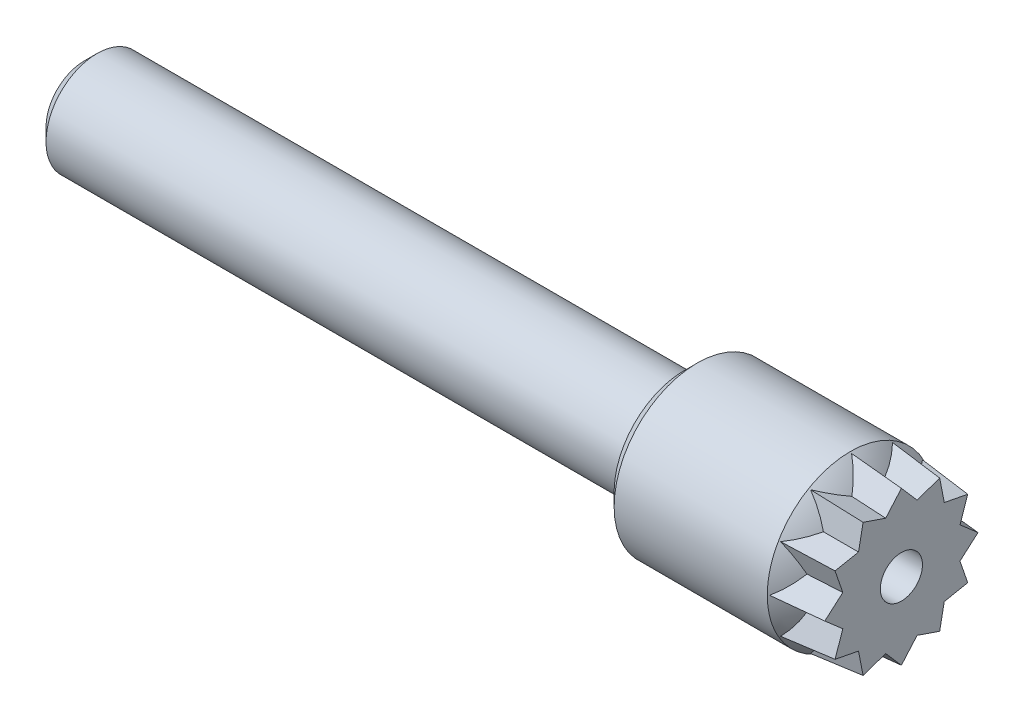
ISO-10303-21;
HEADER;
FILE_DESCRIPTION(('STEP AP214'),'2;1');
FILE_NAME('part.step','',(''),(''),'','','');
FILE_SCHEMA(('AUTOMOTIVE_DESIGN { 1 0 10303 214 1 1 1 1 }'));
ENDSEC;
DATA;
#1=APPLICATION_CONTEXT('core data for automotive mechanical design processes');
#2=APPLICATION_PROTOCOL_DEFINITION('international standard','automotive_design',2000,#1);
#3=PRODUCT_CONTEXT('',#1,'mechanical');
#4=PRODUCT('Part','Part','',(#3));
#5=PRODUCT_RELATED_PRODUCT_CATEGORY('part','',(#4));
#6=PRODUCT_DEFINITION_FORMATION('','',#4);
#7=PRODUCT_DEFINITION_CONTEXT('part definition',#1,'design');
#8=PRODUCT_DEFINITION('design','',#6,#7);
#9=PRODUCT_DEFINITION_SHAPE('','',#8);
#10=(LENGTH_UNIT() NAMED_UNIT(*) SI_UNIT(.MILLI.,.METRE.));
#11=(NAMED_UNIT(*) PLANE_ANGLE_UNIT() SI_UNIT($,.RADIAN.));
#12=(NAMED_UNIT(*) SI_UNIT($,.STERADIAN.) SOLID_ANGLE_UNIT());
#13=UNCERTAINTY_MEASURE_WITH_UNIT(LENGTH_MEASURE(1.E-05),#10,'distance_accuracy_value','');
#14=(GEOMETRIC_REPRESENTATION_CONTEXT(3) GLOBAL_UNCERTAINTY_ASSIGNED_CONTEXT((#13)) GLOBAL_UNIT_ASSIGNED_CONTEXT((#10,
#11,#12)) REPRESENTATION_CONTEXT('',''));
#15=CARTESIAN_POINT('',(0.,0.,0.));
#16=DIRECTION('',(0.,0.,1.));
#17=DIRECTION('',(1.,0.,0.));
#18=AXIS2_PLACEMENT_3D('',#15,#16,#17);
#19=CARTESIAN_POINT('',(-5.54166666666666,0.,0.));
#20=DIRECTION('',(0.,0.,1.));
#21=DIRECTION('',(1.,0.,0.));
#22=AXIS2_PLACEMENT_3D('',#19,#20,#21);
#23=SPHERICAL_SURFACE('',#22,8.54166666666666);
#24=CARTESIAN_POINT('',(-5.22105505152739,4.33641830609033,-1.4890707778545));
#25=DIRECTION('',(0.0697564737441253,0.943488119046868,-0.323981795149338));
#26=DIRECTION('',(0.,0.324772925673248,0.945792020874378));
#27=AXIS2_PLACEMENT_3D('',#24,#25,#26);
#28=CIRCLE('',#27,7.19968208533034);
#29=CARTESIAN_POINT('',(0.097558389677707,5.55602444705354,3.20777221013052));
#30=VERTEX_POINT('',#29);
#31=CARTESIAN_POINT('',(1.40617575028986,4.799354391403,1.2859831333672));
#32=VERTEX_POINT('',#31);
#33=EDGE_CURVE('E55',#30,#32,#28,.T.);
#34=ORIENTED_EDGE('',*,*,#33,.T.);
#35=CARTESIAN_POINT('',(-5.22105505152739,3.01091302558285,3.45778227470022));
#36=DIRECTION('',(0.0697564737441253,0.655093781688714,0.752320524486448));
#37=DIRECTION('',(0.,-0.754157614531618,0.656693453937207));
#38=AXIS2_PLACEMENT_3D('',#35,#36,#37);
#39=CIRCLE('',#38,7.19968208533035);
#40=CARTESIAN_POINT('',(0.0975583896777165,6.41554442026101,0.));
#41=VERTEX_POINT('',#40);
#42=EDGE_CURVE('E59',#32,#41,#39,.T.);
#43=ORIENTED_EDGE('',*,*,#42,.T.);
#44=CARTESIAN_POINT('',(-5.22105505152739,3.01091302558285,-3.45778227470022));
#45=DIRECTION('',(0.0697564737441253,0.655093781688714,-0.752320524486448));
#46=DIRECTION('',(0.,0.754157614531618,0.656693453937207));
#47=AXIS2_PLACEMENT_3D('',#44,#45,#46);
#48=CIRCLE('',#47,7.19968208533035);
#49=CARTESIAN_POINT('',(1.40617575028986,4.799354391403,-1.2859831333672));
#50=VERTEX_POINT('',#49);
#51=EDGE_CURVE('E259',#41,#50,#48,.T.);
#52=ORIENTED_EDGE('',*,*,#51,.T.);
#53=CARTESIAN_POINT('',(-5.22105505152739,4.33641830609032,1.4890707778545));
#54=DIRECTION('',(0.0697564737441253,0.943488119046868,0.32398179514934));
#55=DIRECTION('',(0.,-0.32477292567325,0.945792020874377));
#56=AXIS2_PLACEMENT_3D('',#53,#54,#55);
#57=CIRCLE('',#56,7.19968208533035);
#58=CARTESIAN_POINT('',(0.097558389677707,5.55602444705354,-3.20777221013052));
#59=VERTEX_POINT('',#58);
#60=EDGE_CURVE('E257',#50,#59,#57,.T.);
#61=ORIENTED_EDGE('',*,*,#60,.T.);
#62=CARTESIAN_POINT('',(-5.22105505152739,0.878636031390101,-4.49998380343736));
#63=DIRECTION('',(0.0697564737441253,0.191167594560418,-0.979075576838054));
#64=DIRECTION('',(0.,0.981466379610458,0.191634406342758));
#65=AXIS2_PLACEMENT_3D('',#62,#63,#64);
#66=CIRCLE('',#65,7.19968208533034);
#67=CARTESIAN_POINT('',(1.40617575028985,3.5133712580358,-3.51337125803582));
#68=VERTEX_POINT('',#67);
#69=EDGE_CURVE('E255',#59,#68,#66,.T.);
#70=ORIENTED_EDGE('',*,*,#69,.T.);
#71=CARTESIAN_POINT('',(-5.22105505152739,4.49998380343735,-0.878636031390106));
#72=DIRECTION('',(0.0697564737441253,0.979075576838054,-0.19116759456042));
#73=DIRECTION('',(0.,0.191634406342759,0.981466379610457));
#74=AXIS2_PLACEMENT_3D('',#71,#72,#73);
#75=CIRCLE('',#74,7.19968208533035);
#76=CARTESIAN_POINT('',(0.0975583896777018,3.2077722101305,-5.55602444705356));
#77=VERTEX_POINT('',#76);
#78=EDGE_CURVE('E253',#68,#77,#75,.T.);
#79=ORIENTED_EDGE('',*,*,#78,.T.);
#80=CARTESIAN_POINT('',(-5.22105505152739,-1.48907077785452,-4.33641830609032));
#81=DIRECTION('',(0.0697564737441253,-0.323981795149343,-0.943488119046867));
#82=DIRECTION('',(0.,0.945792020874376,-0.324772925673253));
#83=AXIS2_PLACEMENT_3D('',#80,#81,#82);
#84=CIRCLE('',#83,7.19968208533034);
#85=CARTESIAN_POINT('',(1.40617575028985,1.28598313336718,-4.79935439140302));
#86=VERTEX_POINT('',#85);
#87=EDGE_CURVE('E251',#77,#86,#84,.T.);
#88=ORIENTED_EDGE('',*,*,#87,.T.);
#89=CARTESIAN_POINT('',(-5.22105505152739,3.45778227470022,-3.01091302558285));
#90=DIRECTION('',(0.0697564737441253,0.752320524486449,-0.655093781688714));
#91=DIRECTION('',(0.,0.656693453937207,0.754157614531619));
#92=AXIS2_PLACEMENT_3D('',#89,#90,#91);
#93=CIRCLE('',#92,7.19968208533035);
#94=CARTESIAN_POINT('',(0.097558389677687,0.,-6.41554442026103));
#95=VERTEX_POINT('',#94);
#96=EDGE_CURVE('E249',#86,#95,#93,.T.);
#97=ORIENTED_EDGE('',*,*,#96,.T.);
#98=CARTESIAN_POINT('',(-5.22105505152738,-3.45778227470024,-3.01091302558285));
#99=DIRECTION('',(0.0697564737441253,-0.75232052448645,-0.655093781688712));
#100=DIRECTION('',(0.,0.656693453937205,-0.75415761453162));
#101=AXIS2_PLACEMENT_3D('',#98,#99,#100);
#102=CIRCLE('',#101,7.19968208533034);
#103=CARTESIAN_POINT('',(1.40617575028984,-1.28598313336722,-4.79935439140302));
#104=VERTEX_POINT('',#103);
#105=EDGE_CURVE('E247',#95,#104,#102,.T.);
#106=ORIENTED_EDGE('',*,*,#105,.T.);
#107=CARTESIAN_POINT('',(-5.22105505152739,1.48907077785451,-4.33641830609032));
#108=DIRECTION('',(0.0697564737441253,0.323981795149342,-0.943488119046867));
#109=DIRECTION('',(0.,0.945792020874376,0.324772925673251));
#110=AXIS2_PLACEMENT_3D('',#107,#108,#109);
#111=CIRCLE('',#110,7.19968208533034);
#112=CARTESIAN_POINT('',(0.0975583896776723,-3.20777221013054,-5.55602444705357));
#113=VERTEX_POINT('',#112);
#114=EDGE_CURVE('E245',#104,#113,#111,.T.);
#115=ORIENTED_EDGE('',*,*,#114,.T.);
#116=CARTESIAN_POINT('',(-5.22105505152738,-4.49998380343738,-0.878636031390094));
#117=DIRECTION('',(0.0697564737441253,-0.979075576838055,-0.191167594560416));
#118=DIRECTION('',(0.,0.191634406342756,-0.981466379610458));
#119=AXIS2_PLACEMENT_3D('',#116,#117,#118);
#120=CIRCLE('',#119,7.19968208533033);
#121=CARTESIAN_POINT('',(1.40617575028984,-3.51337125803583,-3.51337125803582));
#122=VERTEX_POINT('',#121);
#123=EDGE_CURVE('E243',#113,#122,#120,.T.);
#124=ORIENTED_EDGE('',*,*,#123,.T.);
#125=CARTESIAN_POINT('',(-5.22105505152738,-0.878636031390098,-4.49998380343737));
#126=DIRECTION('',(0.0697564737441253,-0.191167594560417,-0.979075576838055));
#127=DIRECTION('',(0.,0.981466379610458,-0.191634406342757));
#128=AXIS2_PLACEMENT_3D('',#125,#126,#127);
#129=CIRCLE('',#128,7.19968208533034);
#130=CARTESIAN_POINT('',(0.0975583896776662,-5.55602444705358,-3.20777221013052));
#131=VERTEX_POINT('',#130);
#132=EDGE_CURVE('E241',#122,#131,#129,.T.);
#133=ORIENTED_EDGE('',*,*,#132,.T.);
#134=CARTESIAN_POINT('',(-5.22105505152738,-4.33641830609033,1.48907077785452));
#135=DIRECTION('',(0.0697564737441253,-0.943488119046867,0.323981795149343));
#136=DIRECTION('',(0.,-0.324772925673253,-0.945792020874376));
#137=AXIS2_PLACEMENT_3D('',#134,#135,#136);
#138=CIRCLE('',#137,7.19968208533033);
#139=CARTESIAN_POINT('',(1.40617575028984,-4.79935439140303,-1.2859831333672));
#140=VERTEX_POINT('',#139);
#141=EDGE_CURVE('E239',#131,#140,#138,.T.);
#142=ORIENTED_EDGE('',*,*,#141,.T.);
#143=CARTESIAN_POINT('',(-5.22105505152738,-3.01091302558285,-3.45778227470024));
#144=DIRECTION('',(0.0697564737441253,-0.655093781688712,-0.75232052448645));
#145=DIRECTION('',(0.,0.75415761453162,-0.656693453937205));
#146=AXIS2_PLACEMENT_3D('',#143,#144,#145);
#147=CIRCLE('',#146,7.19968208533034);
#148=CARTESIAN_POINT('',(0.0975583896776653,-6.41554442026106,0.));
#149=VERTEX_POINT('',#148);
#150=EDGE_CURVE('E237',#140,#149,#147,.T.);
#151=ORIENTED_EDGE('',*,*,#150,.T.);
#152=CARTESIAN_POINT('',(-5.22105505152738,-3.01091302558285,3.45778227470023));
#153=DIRECTION('',(0.0697564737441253,-0.655093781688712,0.75232052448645));
#154=DIRECTION('',(0.,-0.75415761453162,-0.656693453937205));
#155=AXIS2_PLACEMENT_3D('',#152,#153,#154);
#156=CIRCLE('',#155,7.19968208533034);
#157=CARTESIAN_POINT('',(1.40617575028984,-4.79935439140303,1.2859831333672));
#158=VERTEX_POINT('',#157);
#159=EDGE_CURVE('E235',#149,#158,#156,.T.);
#160=ORIENTED_EDGE('',*,*,#159,.T.);
#161=CARTESIAN_POINT('',(-5.22105505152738,-4.33641830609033,-1.48907077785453));
#162=DIRECTION('',(0.0697564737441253,-0.943488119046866,-0.323981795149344));
#163=DIRECTION('',(0.,0.324772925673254,-0.945792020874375));
#164=AXIS2_PLACEMENT_3D('',#161,#162,#163);
#165=CIRCLE('',#164,7.19968208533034);
#166=CARTESIAN_POINT('',(0.0975583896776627,-5.55602444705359,3.20777221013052));
#167=VERTEX_POINT('',#166);
#168=EDGE_CURVE('E233',#158,#167,#165,.T.);
#169=ORIENTED_EDGE('',*,*,#168,.T.);
#170=CARTESIAN_POINT('',(-5.22105505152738,-0.878636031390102,4.49998380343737));
#171=DIRECTION('',(0.0697564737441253,-0.191167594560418,0.979075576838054));
#172=DIRECTION('',(0.,-0.981466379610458,-0.191634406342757));
#173=AXIS2_PLACEMENT_3D('',#170,#171,#172);
#174=CIRCLE('',#173,7.19968208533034);
#175=CARTESIAN_POINT('',(1.40617575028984,-3.51337125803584,3.51337125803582));
#176=VERTEX_POINT('',#175);
#177=EDGE_CURVE('E231',#167,#176,#174,.T.);
#178=ORIENTED_EDGE('',*,*,#177,.T.);
#179=CARTESIAN_POINT('',(-5.22105505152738,-4.49998380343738,0.87863603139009));
#180=DIRECTION('',(0.0697564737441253,-0.979075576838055,0.191167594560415));
#181=DIRECTION('',(0.,-0.191634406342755,-0.981466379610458));
#182=AXIS2_PLACEMENT_3D('',#179,#180,#181);
#183=CIRCLE('',#182,7.19968208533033);
#184=CARTESIAN_POINT('',(0.0975583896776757,-3.20777221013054,5.55602444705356));
#185=VERTEX_POINT('',#184);
#186=EDGE_CURVE('E229',#176,#185,#183,.T.);
#187=ORIENTED_EDGE('',*,*,#186,.T.);
#188=CARTESIAN_POINT('',(-5.22105505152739,1.4890707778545,4.33641830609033));
#189=DIRECTION('',(0.0697564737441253,0.32398179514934,0.943488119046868));
#190=DIRECTION('',(0.,-0.945792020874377,0.324772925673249));
#191=AXIS2_PLACEMENT_3D('',#188,#189,#190);
#192=CIRCLE('',#191,7.19968208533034);
#193=CARTESIAN_POINT('',(1.40617575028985,-1.28598313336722,4.79935439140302));
#194=VERTEX_POINT('',#193);
#195=EDGE_CURVE('E227',#185,#194,#192,.T.);
#196=ORIENTED_EDGE('',*,*,#195,.T.);
#197=CARTESIAN_POINT('',(-5.22105505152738,-3.45778227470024,3.01091302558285));
#198=DIRECTION('',(0.0697564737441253,-0.75232052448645,0.655093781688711));
#199=DIRECTION('',(0.,-0.656693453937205,-0.75415761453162));
#200=AXIS2_PLACEMENT_3D('',#197,#198,#199);
#201=CIRCLE('',#200,7.19968208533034);
#202=CARTESIAN_POINT('',(0.0975583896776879,0.,6.41554442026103));
#203=VERTEX_POINT('',#202);
#204=EDGE_CURVE('E225',#194,#203,#201,.T.);
#205=ORIENTED_EDGE('',*,*,#204,.T.);
#206=CARTESIAN_POINT('',(-5.22105505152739,3.45778227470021,3.01091302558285));
#207=DIRECTION('',(0.0697564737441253,0.752320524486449,0.655093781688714));
#208=DIRECTION('',(0.,-0.656693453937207,0.754157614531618));
#209=AXIS2_PLACEMENT_3D('',#206,#207,#208);
#210=CIRCLE('',#209,7.19968208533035);
#211=CARTESIAN_POINT('',(1.40617575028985,1.28598313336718,4.79935439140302));
#212=VERTEX_POINT('',#211);
#213=EDGE_CURVE('E223',#203,#212,#210,.T.);
#214=ORIENTED_EDGE('',*,*,#213,.T.);
#215=CARTESIAN_POINT('',(-5.22105505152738,-1.48907077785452,4.33641830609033));
#216=DIRECTION('',(0.0697564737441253,-0.323981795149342,0.943488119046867));
#217=DIRECTION('',(0.,-0.945792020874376,-0.324772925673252));
#218=AXIS2_PLACEMENT_3D('',#215,#216,#217);
#219=CIRCLE('',#218,7.19968208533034);
#220=CARTESIAN_POINT('',(0.0975583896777,3.20777221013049,5.55602444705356));
#221=VERTEX_POINT('',#220);
#222=EDGE_CURVE('E220',#212,#221,#219,.T.);
#223=ORIENTED_EDGE('',*,*,#222,.T.);
#224=CARTESIAN_POINT('',(-5.22105505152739,4.49998380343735,0.878636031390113));
#225=DIRECTION('',(0.0697564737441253,0.979075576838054,0.191167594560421));
#226=DIRECTION('',(0.,-0.19163440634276,0.981466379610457));
#227=AXIS2_PLACEMENT_3D('',#224,#225,#226);
#228=CIRCLE('',#227,7.19968208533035);
#229=CARTESIAN_POINT('',(1.40617575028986,3.5133712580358,3.51337125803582));
#230=VERTEX_POINT('',#229);
#231=EDGE_CURVE('E218',#221,#230,#228,.T.);
#232=ORIENTED_EDGE('',*,*,#231,.T.);
#233=CARTESIAN_POINT('',(-5.22105505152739,0.878636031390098,4.49998380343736));
#234=DIRECTION('',(0.0697564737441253,0.191167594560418,0.979075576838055));
#235=DIRECTION('',(0.,-0.981466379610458,0.191634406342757));
#236=AXIS2_PLACEMENT_3D('',#233,#234,#235);
#237=CIRCLE('',#236,7.19968208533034);
#238=EDGE_CURVE('E262',#230,#30,#237,.T.);
#239=ORIENTED_EDGE('',*,*,#238,.T.);
#240=EDGE_LOOP('',(#34,#43,#52,#61,#70,#79,#88,#97,#106,#115,#124,#133,#142,#151,#160,#169,#178,
#187,#196,#205,#214,#223,#232,#239));
#241=FACE_BOUND('',#240,.T.);
#242=CARTESIAN_POINT('',(0.,0.,0.));
#243=DIRECTION('',(1.,0.,0.));
#244=DIRECTION('',(0.,1.,0.));
#245=AXIS2_PLACEMENT_3D('',#242,#243,#244);
#246=CIRCLE('',#245,6.5);
#247=CARTESIAN_POINT('',(0.,6.5,0.));
#248=VERTEX_POINT('',#247);
#249=EDGE_CURVE('E383',#248,#248,#246,.T.);
#250=ORIENTED_EDGE('',*,*,#249,.T.);
#251=EDGE_LOOP('',(#250));
#252=FACE_BOUND('',#251,.T.);
#253=ADVANCED_FACE('F40',(#241,#252),#23,.T.);
#254=CARTESIAN_POINT('',(0.,0.,0.));
#255=DIRECTION('',(1.,0.,0.));
#256=DIRECTION('',(0.,1.,0.));
#257=AXIS2_PLACEMENT_3D('',#254,#255,#256);
#258=CYLINDRICAL_SURFACE('',#257,6.5);
#259=CARTESIAN_POINT('',(-12.,0.,0.));
#260=DIRECTION('',(-1.,0.,0.));
#261=DIRECTION('',(0.,-1.,0.));
#262=AXIS2_PLACEMENT_3D('',#259,#260,#261);
#263=CIRCLE('',#262,6.5);
#264=CARTESIAN_POINT('',(-12.,-6.5,0.));
#265=VERTEX_POINT('',#264);
#266=EDGE_CURVE('E386',#265,#265,#263,.F.);
#267=ORIENTED_EDGE('',*,*,#266,.T.);
#268=EDGE_LOOP('',(#267));
#269=FACE_BOUND('',#268,.T.);
#270=ORIENTED_EDGE('',*,*,#249,.F.);
#271=EDGE_LOOP('',(#270));
#272=FACE_BOUND('',#271,.T.);
#273=ADVANCED_FACE('F407',(#269,#272),#258,.T.);
#274=CARTESIAN_POINT('',(-13.,6.5,0.));
#275=DIRECTION('',(-1.,0.,0.));
#276=DIRECTION('',(0.,-1.,0.));
#277=AXIS2_PLACEMENT_3D('',#274,#275,#276);
#278=PLANE('',#277);
#279=CARTESIAN_POINT('',(-13.,0.,0.));
#280=DIRECTION('',(-1.,0.,0.));
#281=DIRECTION('',(0.,-1.,0.));
#282=AXIS2_PLACEMENT_3D('',#279,#280,#281);
#283=CIRCLE('',#282,5.49999999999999);
#284=CARTESIAN_POINT('',(-13.,-5.49999999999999,0.));
#285=VERTEX_POINT('',#284);
#286=EDGE_CURVE('E389',#285,#285,#283,.T.);
#287=ORIENTED_EDGE('',*,*,#286,.T.);
#288=EDGE_LOOP('',(#287));
#289=FACE_BOUND('',#288,.T.);
#290=CARTESIAN_POINT('',(-13.,0.,0.));
#291=DIRECTION('',(1.,0.,0.));
#292=DIRECTION('',(0.,1.,0.));
#293=AXIS2_PLACEMENT_3D('',#290,#291,#292);
#294=CIRCLE('',#293,4.);
#295=CARTESIAN_POINT('',(-13.,4.,0.));
#296=VERTEX_POINT('',#295);
#297=EDGE_CURVE('E380',#296,#296,#294,.T.);
#298=ORIENTED_EDGE('',*,*,#297,.T.);
#299=EDGE_LOOP('',(#298));
#300=FACE_BOUND('',#299,.T.);
#301=ADVANCED_FACE('F412',(#289,#300),#278,.T.);
#302=CARTESIAN_POINT('',(0.,0.,0.));
#303=DIRECTION('',(1.,0.,0.));
#304=DIRECTION('',(0.,1.,0.));
#305=AXIS2_PLACEMENT_3D('',#302,#303,#304);
#306=CYLINDRICAL_SURFACE('',#305,4.);
#307=CARTESIAN_POINT('',(-59.,0.,0.));
#308=DIRECTION('',(-1.,0.,0.));
#309=DIRECTION('',(0.,-1.,0.));
#310=AXIS2_PLACEMENT_3D('',#307,#308,#309);
#311=CIRCLE('',#310,4.);
#312=CARTESIAN_POINT('',(-59.,-4.00000000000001,0.));
#313=VERTEX_POINT('',#312);
#314=EDGE_CURVE('E48',#313,#313,#311,.F.);
#315=ORIENTED_EDGE('',*,*,#314,.T.);
#316=EDGE_LOOP('',(#315));
#317=FACE_BOUND('',#316,.T.);
#318=ORIENTED_EDGE('',*,*,#297,.F.);
#319=EDGE_LOOP('',(#318));
#320=FACE_BOUND('',#319,.T.);
#321=ADVANCED_FACE('F394',(#317,#320),#306,.T.);
#322=CARTESIAN_POINT('',(-60.,3.99999999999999,0.));
#323=DIRECTION('',(-1.,0.,0.));
#324=DIRECTION('',(0.,-1.,0.));
#325=AXIS2_PLACEMENT_3D('',#322,#323,#324);
#326=PLANE('',#325);
#327=CARTESIAN_POINT('',(-60.,0.,0.));
#328=DIRECTION('',(-1.,0.,0.));
#329=DIRECTION('',(0.,-1.,0.));
#330=AXIS2_PLACEMENT_3D('',#327,#328,#329);
#331=CIRCLE('',#330,2.99999999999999);
#332=CARTESIAN_POINT('',(-60.,-3.,0.));
#333=VERTEX_POINT('',#332);
#334=EDGE_CURVE('E11',#333,#333,#331,.T.);
#335=ORIENTED_EDGE('',*,*,#334,.T.);
#336=EDGE_LOOP('',(#335));
#337=FACE_BOUND('',#336,.T.);
#338=ADVANCED_FACE('F422',(#337),#326,.T.);
#339=CARTESIAN_POINT('',(4.,5.19615242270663,3.00000000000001));
#340=DIRECTION('',(0.0697564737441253,0.943488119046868,-0.323981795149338));
#341=DIRECTION('',(0.,0.324772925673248,0.945792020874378));
#342=AXIS2_PLACEMENT_3D('',#339,#340,#341);
#343=PLANE('',#342);
#344=ORIENTED_EDGE('',*,*,#33,.F.);
#345=DIRECTION('',(0.99437842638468,-0.0916987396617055,-0.0529422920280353));
#346=VECTOR('',#345,1.);
#347=CARTESIAN_POINT('',(4.,5.19615242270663,3.00000000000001));
#348=LINE('',#347,#346);
#349=CARTESIAN_POINT('',(4.,5.19615242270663,3.00000000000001));
#350=VERTEX_POINT('',#349);
#351=EDGE_CURVE('E332',#30,#350,#348,.T.);
#352=ORIENTED_EDGE('',*,*,#351,.T.);
#353=DIRECTION('',(0.,0.324772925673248,0.945792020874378));
#354=VECTOR('',#353,1.);
#355=CARTESIAN_POINT('',(4.,5.19615242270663,3.00000000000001));
#356=LINE('',#355,#354);
#357=CARTESIAN_POINT('',(4.,4.58814767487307,1.22939046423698));
#358=VERTEX_POINT('',#357);
#359=EDGE_CURVE('E209',#358,#350,#356,.T.);
#360=ORIENTED_EDGE('',*,*,#359,.F.);
#361=DIRECTION('',(0.996465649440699,-0.0811389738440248,-0.0217411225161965));
#362=VECTOR('',#361,1.);
#363=CARTESIAN_POINT('',(3.91248249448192,4.59527394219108,1.23129994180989));
#364=LINE('',#363,#362);
#365=EDGE_CURVE('E221',#32,#358,#364,.T.);
#366=ORIENTED_EDGE('',*,*,#365,.F.);
#367=EDGE_LOOP('',(#344,#352,#360,#366));
#368=FACE_BOUND('',#367,.T.);
#369=ADVANCED_FACE('F425',(#368),#343,.T.);
#370=CARTESIAN_POINT('',(4.,4.58814767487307,1.22939046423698));
#371=DIRECTION('',(0.0697564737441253,0.655093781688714,0.752320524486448));
#372=DIRECTION('',(0.,-0.754157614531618,0.656693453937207));
#373=AXIS2_PLACEMENT_3D('',#370,#371,#372);
#374=PLANE('',#373);
#375=ORIENTED_EDGE('',*,*,#42,.F.);
#376=ORIENTED_EDGE('',*,*,#365,.T.);
#377=DIRECTION('',(0.,-0.754157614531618,0.656693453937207));
#378=VECTOR('',#377,1.);
#379=CARTESIAN_POINT('',(4.,4.58814767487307,1.22939046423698));
#380=LINE('',#379,#378);
#381=CARTESIAN_POINT('',(4.,6.,0.));
#382=VERTEX_POINT('',#381);
#383=EDGE_CURVE('E329',#382,#358,#380,.T.);
#384=ORIENTED_EDGE('',*,*,#383,.F.);
#385=DIRECTION('',(0.99437842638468,-0.10588458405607,0.));
#386=VECTOR('',#385,1.);
#387=CARTESIAN_POINT('',(4.,6.,0.));
#388=LINE('',#387,#386);
#389=EDGE_CURVE('E334',#41,#382,#388,.T.);
#390=ORIENTED_EDGE('',*,*,#389,.F.);
#391=EDGE_LOOP('',(#375,#376,#384,#390));
#392=FACE_BOUND('',#391,.T.);
#393=ADVANCED_FACE('F427',(#392),#374,.T.);
#394=CARTESIAN_POINT('',(4.,6.,0.));
#395=DIRECTION('',(0.0697564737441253,0.655093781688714,-0.752320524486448));
#396=DIRECTION('',(0.,0.754157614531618,0.656693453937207));
#397=AXIS2_PLACEMENT_3D('',#394,#395,#396);
#398=PLANE('',#397);
#399=ORIENTED_EDGE('',*,*,#51,.F.);
#400=ORIENTED_EDGE('',*,*,#389,.T.);
#401=DIRECTION('',(0.,0.754157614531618,0.656693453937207));
#402=VECTOR('',#401,1.);
#403=CARTESIAN_POINT('',(4.,6.,0.));
#404=LINE('',#403,#402);
#405=CARTESIAN_POINT('',(4.,4.58814767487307,-1.22939046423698));
#406=VERTEX_POINT('',#405);
#407=EDGE_CURVE('E326',#406,#382,#404,.T.);
#408=ORIENTED_EDGE('',*,*,#407,.F.);
#409=DIRECTION('',(0.996465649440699,-0.0811389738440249,0.0217411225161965));
#410=VECTOR('',#409,1.);
#411=CARTESIAN_POINT('',(3.91248249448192,4.59527394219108,-1.23129994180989));
#412=LINE('',#411,#410);
#413=EDGE_CURVE('E376',#50,#406,#412,.T.);
#414=ORIENTED_EDGE('',*,*,#413,.F.);
#415=EDGE_LOOP('',(#399,#400,#408,#414));
#416=FACE_BOUND('',#415,.T.);
#417=ADVANCED_FACE('F430',(#416),#398,.T.);
#418=CARTESIAN_POINT('',(4.,4.58814767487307,-1.22939046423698));
#419=DIRECTION('',(0.0697564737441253,0.943488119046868,0.32398179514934));
#420=DIRECTION('',(0.,-0.32477292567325,0.945792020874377));
#421=AXIS2_PLACEMENT_3D('',#418,#419,#420);
#422=PLANE('',#421);
#423=ORIENTED_EDGE('',*,*,#60,.F.);
#424=ORIENTED_EDGE('',*,*,#413,.T.);
#425=DIRECTION('',(0.,-0.32477292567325,0.945792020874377));
#426=VECTOR('',#425,1.);
#427=CARTESIAN_POINT('',(4.,4.58814767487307,-1.22939046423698));
#428=LINE('',#427,#426);
#429=CARTESIAN_POINT('',(4.,5.19615242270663,-3.00000000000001));
#430=VERTEX_POINT('',#429);
#431=EDGE_CURVE('E323',#430,#406,#428,.T.);
#432=ORIENTED_EDGE('',*,*,#431,.F.);
#433=DIRECTION('',(0.99437842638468,-0.0916987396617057,0.0529422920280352));
#434=VECTOR('',#433,1.);
#435=CARTESIAN_POINT('',(4.,5.19615242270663,-3.00000000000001));
#436=LINE('',#435,#434);
#437=EDGE_CURVE('E374',#59,#430,#436,.T.);
#438=ORIENTED_EDGE('',*,*,#437,.F.);
#439=EDGE_LOOP('',(#423,#424,#432,#438));
#440=FACE_BOUND('',#439,.T.);
#441=ADVANCED_FACE('F434',(#440),#422,.T.);
#442=CARTESIAN_POINT('',(4.,5.19615242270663,-3.00000000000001));
#443=DIRECTION('',(0.0697564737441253,0.191167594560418,-0.979075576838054));
#444=DIRECTION('',(0.,0.981466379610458,0.191634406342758));
#445=AXIS2_PLACEMENT_3D('',#442,#443,#444);
#446=PLANE('',#445);
#447=ORIENTED_EDGE('',*,*,#69,.F.);
#448=ORIENTED_EDGE('',*,*,#437,.T.);
#449=DIRECTION('',(0.,0.981466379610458,0.191634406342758));
#450=VECTOR('',#449,1.);
#451=CARTESIAN_POINT('',(4.,5.19615242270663,-3.00000000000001));
#452=LINE('',#451,#450);
#453=CARTESIAN_POINT('',(4.,3.3587572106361,-3.35875721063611));
#454=VERTEX_POINT('',#453);
#455=EDGE_CURVE('E320',#454,#430,#452,.T.);
#456=ORIENTED_EDGE('',*,*,#455,.F.);
#457=DIRECTION('',(0.996465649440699,-0.0593978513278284,0.0593978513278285));
#458=VECTOR('',#457,1.);
#459=CARTESIAN_POINT('',(3.91248249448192,3.3639740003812,-3.36397400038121));
#460=LINE('',#459,#458);
#461=EDGE_CURVE('E372',#68,#454,#460,.T.);
#462=ORIENTED_EDGE('',*,*,#461,.F.);
#463=EDGE_LOOP('',(#447,#448,#456,#462));
#464=FACE_BOUND('',#463,.T.);
#465=ADVANCED_FACE('F438',(#464),#446,.T.);
#466=CARTESIAN_POINT('',(4.,3.3587572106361,-3.35875721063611));
#467=DIRECTION('',(0.0697564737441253,0.979075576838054,-0.19116759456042));
#468=DIRECTION('',(0.,0.191634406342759,0.981466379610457));
#469=AXIS2_PLACEMENT_3D('',#466,#467,#468);
#470=PLANE('',#469);
#471=ORIENTED_EDGE('',*,*,#78,.F.);
#472=ORIENTED_EDGE('',*,*,#461,.T.);
#473=DIRECTION('',(0.,0.191634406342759,0.981466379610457));
#474=VECTOR('',#473,1.);
#475=CARTESIAN_POINT('',(4.,3.3587572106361,-3.35875721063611));
#476=LINE('',#475,#474);
#477=CARTESIAN_POINT('',(4.,2.99999999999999,-5.19615242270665));
#478=VERTEX_POINT('',#477);
#479=EDGE_CURVE('E317',#478,#454,#476,.T.);
#480=ORIENTED_EDGE('',*,*,#479,.F.);
#481=DIRECTION('',(0.99437842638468,-0.0529422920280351,0.0916987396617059));
#482=VECTOR('',#481,1.);
#483=CARTESIAN_POINT('',(4.,2.99999999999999,-5.19615242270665));
#484=LINE('',#483,#482);
#485=EDGE_CURVE('E370',#77,#478,#484,.T.);
#486=ORIENTED_EDGE('',*,*,#485,.F.);
#487=EDGE_LOOP('',(#471,#472,#480,#486));
#488=FACE_BOUND('',#487,.T.);
#489=ADVANCED_FACE('F442',(#488),#470,.T.);
#490=CARTESIAN_POINT('',(4.,2.99999999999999,-5.19615242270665));
#491=DIRECTION('',(0.0697564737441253,-0.323981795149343,-0.943488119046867));
#492=DIRECTION('',(0.,0.945792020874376,-0.324772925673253));
#493=AXIS2_PLACEMENT_3D('',#490,#491,#492);
#494=PLANE('',#493);
#495=ORIENTED_EDGE('',*,*,#87,.F.);
#496=ORIENTED_EDGE('',*,*,#485,.T.);
#497=DIRECTION('',(0.,0.945792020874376,-0.324772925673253));
#498=VECTOR('',#497,1.);
#499=CARTESIAN_POINT('',(4.,2.99999999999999,-5.19615242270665));
#500=LINE('',#499,#498);
#501=CARTESIAN_POINT('',(4.,1.22939046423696,-4.58814767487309));
#502=VERTEX_POINT('',#501);
#503=EDGE_CURVE('E314',#502,#478,#500,.T.);
#504=ORIENTED_EDGE('',*,*,#503,.F.);
#505=DIRECTION('',(0.996465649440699,-0.0217411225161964,0.081138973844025));
#506=VECTOR('',#505,1.);
#507=CARTESIAN_POINT('',(3.91248249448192,1.23129994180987,-4.5952739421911));
#508=LINE('',#507,#506);
#509=EDGE_CURVE('E368',#86,#502,#508,.T.);
#510=ORIENTED_EDGE('',*,*,#509,.F.);
#511=EDGE_LOOP('',(#495,#496,#504,#510));
#512=FACE_BOUND('',#511,.T.);
#513=ADVANCED_FACE('F446',(#512),#494,.T.);
#514=CARTESIAN_POINT('',(4.,1.22939046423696,-4.58814767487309));
#515=DIRECTION('',(0.0697564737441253,0.752320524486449,-0.655093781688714));
#516=DIRECTION('',(0.,0.656693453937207,0.754157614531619));
#517=AXIS2_PLACEMENT_3D('',#514,#515,#516);
#518=PLANE('',#517);
#519=ORIENTED_EDGE('',*,*,#96,.F.);
#520=ORIENTED_EDGE('',*,*,#509,.T.);
#521=DIRECTION('',(0.,0.656693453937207,0.754157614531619));
#522=VECTOR('',#521,1.);
#523=CARTESIAN_POINT('',(4.,1.22939046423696,-4.58814767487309));
#524=LINE('',#523,#522);
#525=CARTESIAN_POINT('',(4.,0.,-6.00000000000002));
#526=VERTEX_POINT('',#525);
#527=EDGE_CURVE('E311',#526,#502,#524,.T.);
#528=ORIENTED_EDGE('',*,*,#527,.F.);
#529=DIRECTION('',(0.99437842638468,0.,0.105884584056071));
#530=VECTOR('',#529,1.);
#531=CARTESIAN_POINT('',(4.,0.,-6.00000000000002));
#532=LINE('',#531,#530);
#533=EDGE_CURVE('E366',#95,#526,#532,.T.);
#534=ORIENTED_EDGE('',*,*,#533,.F.);
#535=EDGE_LOOP('',(#519,#520,#528,#534));
#536=FACE_BOUND('',#535,.T.);
#537=ADVANCED_FACE('F450',(#536),#518,.T.);
#538=CARTESIAN_POINT('',(4.,0.,-6.00000000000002));
#539=DIRECTION('',(0.0697564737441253,-0.75232052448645,-0.655093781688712));
#540=DIRECTION('',(0.,0.656693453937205,-0.75415761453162));
#541=AXIS2_PLACEMENT_3D('',#538,#539,#540);
#542=PLANE('',#541);
#543=ORIENTED_EDGE('',*,*,#105,.F.);
#544=ORIENTED_EDGE('',*,*,#533,.T.);
#545=DIRECTION('',(0.,0.656693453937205,-0.75415761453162));
#546=VECTOR('',#545,1.);
#547=CARTESIAN_POINT('',(4.,0.,-6.00000000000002));
#548=LINE('',#547,#546);
#549=CARTESIAN_POINT('',(4.,-1.22939046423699,-4.58814767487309));
#550=VERTEX_POINT('',#549);
#551=EDGE_CURVE('E308',#550,#526,#548,.T.);
#552=ORIENTED_EDGE('',*,*,#551,.F.);
#553=DIRECTION('',(0.996465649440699,0.0217411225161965,0.081138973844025));
#554=VECTOR('',#553,1.);
#555=CARTESIAN_POINT('',(3.91248249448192,-1.2312999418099,-4.5952739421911));
#556=LINE('',#555,#554);
#557=EDGE_CURVE('E364',#104,#550,#556,.T.);
#558=ORIENTED_EDGE('',*,*,#557,.F.);
#559=EDGE_LOOP('',(#543,#544,#552,#558));
#560=FACE_BOUND('',#559,.T.);
#561=ADVANCED_FACE('F454',(#560),#542,.T.);
#562=CARTESIAN_POINT('',(4.,-1.22939046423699,-4.58814767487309));
#563=DIRECTION('',(0.0697564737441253,0.323981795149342,-0.943488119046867));
#564=DIRECTION('',(0.,0.945792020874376,0.324772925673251));
#565=AXIS2_PLACEMENT_3D('',#562,#563,#564);
#566=PLANE('',#565);
#567=ORIENTED_EDGE('',*,*,#114,.F.);
#568=ORIENTED_EDGE('',*,*,#557,.T.);
#569=DIRECTION('',(0.,0.945792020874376,0.324772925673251));
#570=VECTOR('',#569,1.);
#571=CARTESIAN_POINT('',(4.,-1.22939046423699,-4.58814767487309));
#572=LINE('',#571,#570);
#573=CARTESIAN_POINT('',(4.,-3.00000000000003,-5.19615242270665));
#574=VERTEX_POINT('',#573);
#575=EDGE_CURVE('E305',#574,#550,#572,.T.);
#576=ORIENTED_EDGE('',*,*,#575,.F.);
#577=DIRECTION('',(0.99437842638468,0.0529422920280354,0.0916987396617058));
#578=VECTOR('',#577,1.);
#579=CARTESIAN_POINT('',(4.,-3.00000000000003,-5.19615242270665));
#580=LINE('',#579,#578);
#581=EDGE_CURVE('E362',#113,#574,#580,.T.);
#582=ORIENTED_EDGE('',*,*,#581,.F.);
#583=EDGE_LOOP('',(#567,#568,#576,#582));
#584=FACE_BOUND('',#583,.T.);
#585=ADVANCED_FACE('F458',(#584),#566,.T.);
#586=CARTESIAN_POINT('',(4.,-3.00000000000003,-5.19615242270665));
#587=DIRECTION('',(0.0697564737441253,-0.979075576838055,-0.191167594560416));
#588=DIRECTION('',(0.,0.191634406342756,-0.981466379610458));
#589=AXIS2_PLACEMENT_3D('',#586,#587,#588);
#590=PLANE('',#589);
#591=ORIENTED_EDGE('',*,*,#123,.F.);
#592=ORIENTED_EDGE('',*,*,#581,.T.);
#593=DIRECTION('',(0.,0.191634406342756,-0.981466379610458));
#594=VECTOR('',#593,1.);
#595=CARTESIAN_POINT('',(4.,-3.00000000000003,-5.19615242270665));
#596=LINE('',#595,#594);
#597=CARTESIAN_POINT('',(4.,-3.35875721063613,-3.35875721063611));
#598=VERTEX_POINT('',#597);
#599=EDGE_CURVE('E302',#598,#574,#596,.T.);
#600=ORIENTED_EDGE('',*,*,#599,.F.);
#601=DIRECTION('',(0.996465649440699,0.0593978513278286,0.0593978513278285));
#602=VECTOR('',#601,1.);
#603=CARTESIAN_POINT('',(3.91248249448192,-3.36397400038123,-3.36397400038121));
#604=LINE('',#603,#602);
#605=EDGE_CURVE('E360',#122,#598,#604,.T.);
#606=ORIENTED_EDGE('',*,*,#605,.F.);
#607=EDGE_LOOP('',(#591,#592,#600,#606));
#608=FACE_BOUND('',#607,.T.);
#609=ADVANCED_FACE('F462',(#608),#590,.T.);
#610=CARTESIAN_POINT('',(4.,-3.35875721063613,-3.35875721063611));
#611=DIRECTION('',(0.0697564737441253,-0.191167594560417,-0.979075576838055));
#612=DIRECTION('',(0.,0.981466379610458,-0.191634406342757));
#613=AXIS2_PLACEMENT_3D('',#610,#611,#612);
#614=PLANE('',#613);
#615=ORIENTED_EDGE('',*,*,#132,.F.);
#616=ORIENTED_EDGE('',*,*,#605,.T.);
#617=DIRECTION('',(0.,0.981466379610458,-0.191634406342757));
#618=VECTOR('',#617,1.);
#619=CARTESIAN_POINT('',(4.,-3.35875721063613,-3.35875721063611));
#620=LINE('',#619,#618);
#621=CARTESIAN_POINT('',(4.,-5.19615242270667,-3.00000000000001));
#622=VERTEX_POINT('',#621);
#623=EDGE_CURVE('E299',#622,#598,#620,.T.);
#624=ORIENTED_EDGE('',*,*,#623,.F.);
#625=DIRECTION('',(0.99437842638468,0.0916987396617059,0.0529422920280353));
#626=VECTOR('',#625,1.);
#627=CARTESIAN_POINT('',(4.,-5.19615242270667,-3.00000000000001));
#628=LINE('',#627,#626);
#629=EDGE_CURVE('E358',#131,#622,#628,.T.);
#630=ORIENTED_EDGE('',*,*,#629,.F.);
#631=EDGE_LOOP('',(#615,#616,#624,#630));
#632=FACE_BOUND('',#631,.T.);
#633=ADVANCED_FACE('F466',(#632),#614,.T.);
#634=CARTESIAN_POINT('',(4.,-5.19615242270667,-3.00000000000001));
#635=DIRECTION('',(0.0697564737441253,-0.943488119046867,0.323981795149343));
#636=DIRECTION('',(0.,-0.324772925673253,-0.945792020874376));
#637=AXIS2_PLACEMENT_3D('',#634,#635,#636);
#638=PLANE('',#637);
#639=ORIENTED_EDGE('',*,*,#141,.F.);
#640=ORIENTED_EDGE('',*,*,#629,.T.);
#641=DIRECTION('',(0.,-0.324772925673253,-0.945792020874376));
#642=VECTOR('',#641,1.);
#643=CARTESIAN_POINT('',(4.,-5.19615242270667,-3.00000000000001));
#644=LINE('',#643,#642);
#645=CARTESIAN_POINT('',(4.,-4.58814767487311,-1.22939046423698));
#646=VERTEX_POINT('',#645);
#647=EDGE_CURVE('E296',#646,#622,#644,.T.);
#648=ORIENTED_EDGE('',*,*,#647,.F.);
#649=DIRECTION('',(0.996465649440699,0.081138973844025,0.0217411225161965));
#650=VECTOR('',#649,1.);
#651=CARTESIAN_POINT('',(3.91248249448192,-4.59527394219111,-1.23129994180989));
#652=LINE('',#651,#650);
#653=EDGE_CURVE('E356',#140,#646,#652,.T.);
#654=ORIENTED_EDGE('',*,*,#653,.F.);
#655=EDGE_LOOP('',(#639,#640,#648,#654));
#656=FACE_BOUND('',#655,.T.);
#657=ADVANCED_FACE('F470',(#656),#638,.T.);
#658=CARTESIAN_POINT('',(4.,-4.58814767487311,-1.22939046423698));
#659=DIRECTION('',(0.0697564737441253,-0.655093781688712,-0.75232052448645));
#660=DIRECTION('',(0.,0.75415761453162,-0.656693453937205));
#661=AXIS2_PLACEMENT_3D('',#658,#659,#660);
#662=PLANE('',#661);
#663=ORIENTED_EDGE('',*,*,#150,.F.);
#664=ORIENTED_EDGE('',*,*,#653,.T.);
#665=DIRECTION('',(0.,0.75415761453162,-0.656693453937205));
#666=VECTOR('',#665,1.);
#667=CARTESIAN_POINT('',(4.,-4.58814767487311,-1.22939046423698));
#668=LINE('',#667,#666);
#669=CARTESIAN_POINT('',(4.,-6.00000000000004,0.));
#670=VERTEX_POINT('',#669);
#671=EDGE_CURVE('E293',#670,#646,#668,.T.);
#672=ORIENTED_EDGE('',*,*,#671,.F.);
#673=DIRECTION('',(0.99437842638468,0.105884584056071,0.));
#674=VECTOR('',#673,1.);
#675=CARTESIAN_POINT('',(4.,-6.00000000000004,0.));
#676=LINE('',#675,#674);
#677=EDGE_CURVE('E354',#149,#670,#676,.T.);
#678=ORIENTED_EDGE('',*,*,#677,.F.);
#679=EDGE_LOOP('',(#663,#664,#672,#678));
#680=FACE_BOUND('',#679,.T.);
#681=ADVANCED_FACE('F474',(#680),#662,.T.);
#682=CARTESIAN_POINT('',(4.,-6.00000000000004,0.));
#683=DIRECTION('',(0.0697564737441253,-0.655093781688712,0.75232052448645));
#684=DIRECTION('',(0.,-0.75415761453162,-0.656693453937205));
#685=AXIS2_PLACEMENT_3D('',#682,#683,#684);
#686=PLANE('',#685);
#687=ORIENTED_EDGE('',*,*,#159,.F.);
#688=ORIENTED_EDGE('',*,*,#677,.T.);
#689=DIRECTION('',(0.,-0.75415761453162,-0.656693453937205));
#690=VECTOR('',#689,1.);
#691=CARTESIAN_POINT('',(4.,-6.00000000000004,0.));
#692=LINE('',#691,#690);
#693=CARTESIAN_POINT('',(4.,-4.58814767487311,1.22939046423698));
#694=VERTEX_POINT('',#693);
#695=EDGE_CURVE('E290',#694,#670,#692,.T.);
#696=ORIENTED_EDGE('',*,*,#695,.F.);
#697=DIRECTION('',(0.996465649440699,0.0811389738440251,-0.0217411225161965));
#698=VECTOR('',#697,1.);
#699=CARTESIAN_POINT('',(3.91248249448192,-4.59527394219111,1.23129994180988));
#700=LINE('',#699,#698);
#701=EDGE_CURVE('E352',#158,#694,#700,.T.);
#702=ORIENTED_EDGE('',*,*,#701,.F.);
#703=EDGE_LOOP('',(#687,#688,#696,#702));
#704=FACE_BOUND('',#703,.T.);
#705=ADVANCED_FACE('F478',(#704),#686,.T.);
#706=CARTESIAN_POINT('',(4.,-4.58814767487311,1.22939046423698));
#707=DIRECTION('',(0.0697564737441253,-0.943488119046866,-0.323981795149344));
#708=DIRECTION('',(0.,0.324772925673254,-0.945792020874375));
#709=AXIS2_PLACEMENT_3D('',#706,#707,#708);
#710=PLANE('',#709);
#711=ORIENTED_EDGE('',*,*,#168,.F.);
#712=ORIENTED_EDGE('',*,*,#701,.T.);
#713=DIRECTION('',(0.,0.324772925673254,-0.945792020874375));
#714=VECTOR('',#713,1.);
#715=CARTESIAN_POINT('',(4.,-4.58814767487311,1.22939046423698));
#716=LINE('',#715,#714);
#717=CARTESIAN_POINT('',(4.,-5.19615242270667,3.00000000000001));
#718=VERTEX_POINT('',#717);
#719=EDGE_CURVE('E287',#718,#694,#716,.T.);
#720=ORIENTED_EDGE('',*,*,#719,.F.);
#721=DIRECTION('',(0.99437842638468,0.091698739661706,-0.0529422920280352));
#722=VECTOR('',#721,1.);
#723=CARTESIAN_POINT('',(4.,-5.19615242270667,3.00000000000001));
#724=LINE('',#723,#722);
#725=EDGE_CURVE('E350',#167,#718,#724,.T.);
#726=ORIENTED_EDGE('',*,*,#725,.F.);
#727=EDGE_LOOP('',(#711,#712,#720,#726));
#728=FACE_BOUND('',#727,.T.);
#729=ADVANCED_FACE('F482',(#728),#710,.T.);
#730=CARTESIAN_POINT('',(4.,-5.19615242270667,3.00000000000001));
#731=DIRECTION('',(0.0697564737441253,-0.191167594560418,0.979075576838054));
#732=DIRECTION('',(0.,-0.981466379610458,-0.191634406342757));
#733=AXIS2_PLACEMENT_3D('',#730,#731,#732);
#734=PLANE('',#733);
#735=ORIENTED_EDGE('',*,*,#177,.F.);
#736=ORIENTED_EDGE('',*,*,#725,.T.);
#737=DIRECTION('',(0.,-0.981466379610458,-0.191634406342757));
#738=VECTOR('',#737,1.);
#739=CARTESIAN_POINT('',(4.,-5.19615242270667,3.00000000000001));
#740=LINE('',#739,#738);
#741=CARTESIAN_POINT('',(4.,-3.35875721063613,3.35875721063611));
#742=VERTEX_POINT('',#741);
#743=EDGE_CURVE('E284',#742,#718,#740,.T.);
#744=ORIENTED_EDGE('',*,*,#743,.F.);
#745=DIRECTION('',(0.996465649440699,0.0593978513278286,-0.0593978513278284));
#746=VECTOR('',#745,1.);
#747=CARTESIAN_POINT('',(3.91248249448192,-3.36397400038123,3.36397400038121));
#748=LINE('',#747,#746);
#749=EDGE_CURVE('E348',#176,#742,#748,.T.);
#750=ORIENTED_EDGE('',*,*,#749,.F.);
#751=EDGE_LOOP('',(#735,#736,#744,#750));
#752=FACE_BOUND('',#751,.T.);
#753=ADVANCED_FACE('F486',(#752),#734,.T.);
#754=CARTESIAN_POINT('',(4.,-3.35875721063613,3.35875721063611));
#755=DIRECTION('',(0.0697564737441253,-0.979075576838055,0.191167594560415));
#756=DIRECTION('',(0.,-0.191634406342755,-0.981466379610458));
#757=AXIS2_PLACEMENT_3D('',#754,#755,#756);
#758=PLANE('',#757);
#759=ORIENTED_EDGE('',*,*,#186,.F.);
#760=ORIENTED_EDGE('',*,*,#749,.T.);
#761=DIRECTION('',(0.,-0.191634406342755,-0.981466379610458));
#762=VECTOR('',#761,1.);
#763=CARTESIAN_POINT('',(4.,-3.35875721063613,3.35875721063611));
#764=LINE('',#763,#762);
#765=CARTESIAN_POINT('',(4.,-3.00000000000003,5.19615242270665));
#766=VERTEX_POINT('',#765);
#767=EDGE_CURVE('E281',#766,#742,#764,.T.);
#768=ORIENTED_EDGE('',*,*,#767,.F.);
#769=DIRECTION('',(0.99437842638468,0.0529422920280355,-0.0916987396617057));
#770=VECTOR('',#769,1.);
#771=CARTESIAN_POINT('',(4.,-3.00000000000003,5.19615242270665));
#772=LINE('',#771,#770);
#773=EDGE_CURVE('E346',#185,#766,#772,.T.);
#774=ORIENTED_EDGE('',*,*,#773,.F.);
#775=EDGE_LOOP('',(#759,#760,#768,#774));
#776=FACE_BOUND('',#775,.T.);
#777=ADVANCED_FACE('F490',(#776),#758,.T.);
#778=CARTESIAN_POINT('',(4.,-3.00000000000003,5.19615242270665));
#779=DIRECTION('',(0.0697564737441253,0.32398179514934,0.943488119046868));
#780=DIRECTION('',(0.,-0.945792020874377,0.324772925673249));
#781=AXIS2_PLACEMENT_3D('',#778,#779,#780);
#782=PLANE('',#781);
#783=ORIENTED_EDGE('',*,*,#195,.F.);
#784=ORIENTED_EDGE('',*,*,#773,.T.);
#785=DIRECTION('',(0.,-0.945792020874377,0.324772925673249));
#786=VECTOR('',#785,1.);
#787=CARTESIAN_POINT('',(4.,-3.00000000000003,5.19615242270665));
#788=LINE('',#787,#786);
#789=CARTESIAN_POINT('',(4.,-1.22939046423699,4.58814767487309));
#790=VERTEX_POINT('',#789);
#791=EDGE_CURVE('E278',#790,#766,#788,.T.);
#792=ORIENTED_EDGE('',*,*,#791,.F.);
#793=DIRECTION('',(0.996465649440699,0.0217411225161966,-0.0811389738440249));
#794=VECTOR('',#793,1.);
#795=CARTESIAN_POINT('',(3.91248249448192,-1.2312999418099,4.5952739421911));
#796=LINE('',#795,#794);
#797=EDGE_CURVE('E344',#194,#790,#796,.T.);
#798=ORIENTED_EDGE('',*,*,#797,.F.);
#799=EDGE_LOOP('',(#783,#784,#792,#798));
#800=FACE_BOUND('',#799,.T.);
#801=ADVANCED_FACE('F494',(#800),#782,.T.);
#802=CARTESIAN_POINT('',(4.,-1.22939046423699,4.58814767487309));
#803=DIRECTION('',(0.0697564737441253,-0.75232052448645,0.655093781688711));
#804=DIRECTION('',(0.,-0.656693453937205,-0.75415761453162));
#805=AXIS2_PLACEMENT_3D('',#802,#803,#804);
#806=PLANE('',#805);
#807=ORIENTED_EDGE('',*,*,#204,.F.);
#808=ORIENTED_EDGE('',*,*,#797,.T.);
#809=DIRECTION('',(0.,-0.656693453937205,-0.75415761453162));
#810=VECTOR('',#809,1.);
#811=CARTESIAN_POINT('',(4.,-1.22939046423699,4.58814767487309));
#812=LINE('',#811,#810);
#813=CARTESIAN_POINT('',(4.,0.,6.00000000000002));
#814=VERTEX_POINT('',#813);
#815=EDGE_CURVE('E275',#814,#790,#812,.T.);
#816=ORIENTED_EDGE('',*,*,#815,.F.);
#817=DIRECTION('',(0.99437842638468,0.,-0.105884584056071));
#818=VECTOR('',#817,1.);
#819=CARTESIAN_POINT('',(4.,0.,6.00000000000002));
#820=LINE('',#819,#818);
#821=EDGE_CURVE('E342',#203,#814,#820,.T.);
#822=ORIENTED_EDGE('',*,*,#821,.F.);
#823=EDGE_LOOP('',(#807,#808,#816,#822));
#824=FACE_BOUND('',#823,.T.);
#825=ADVANCED_FACE('F498',(#824),#806,.T.);
#826=CARTESIAN_POINT('',(4.,0.,6.00000000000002));
#827=DIRECTION('',(0.0697564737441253,0.752320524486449,0.655093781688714));
#828=DIRECTION('',(0.,-0.656693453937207,0.754157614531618));
#829=AXIS2_PLACEMENT_3D('',#826,#827,#828);
#830=PLANE('',#829);
#831=ORIENTED_EDGE('',*,*,#213,.F.);
#832=ORIENTED_EDGE('',*,*,#821,.T.);
#833=DIRECTION('',(0.,-0.656693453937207,0.754157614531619));
#834=VECTOR('',#833,1.);
#835=CARTESIAN_POINT('',(4.,0.,6.00000000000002));
#836=LINE('',#835,#834);
#837=CARTESIAN_POINT('',(4.,1.22939046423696,4.58814767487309));
#838=VERTEX_POINT('',#837);
#839=EDGE_CURVE('E272',#838,#814,#836,.T.);
#840=ORIENTED_EDGE('',*,*,#839,.F.);
#841=DIRECTION('',(0.996465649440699,-0.0217411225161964,-0.081138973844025));
#842=VECTOR('',#841,1.);
#843=CARTESIAN_POINT('',(3.91248249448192,1.23129994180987,4.5952739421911));
#844=LINE('',#843,#842);
#845=EDGE_CURVE('E340',#212,#838,#844,.T.);
#846=ORIENTED_EDGE('',*,*,#845,.F.);
#847=EDGE_LOOP('',(#831,#832,#840,#846));
#848=FACE_BOUND('',#847,.T.);
#849=ADVANCED_FACE('F502',(#848),#830,.T.);
#850=CARTESIAN_POINT('',(4.,1.22939046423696,4.58814767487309));
#851=DIRECTION('',(0.0697564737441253,-0.323981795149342,0.943488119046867));
#852=DIRECTION('',(0.,-0.945792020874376,-0.324772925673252));
#853=AXIS2_PLACEMENT_3D('',#850,#851,#852);
#854=PLANE('',#853);
#855=ORIENTED_EDGE('',*,*,#222,.F.);
#856=ORIENTED_EDGE('',*,*,#845,.T.);
#857=DIRECTION('',(0.,-0.945792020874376,-0.324772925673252));
#858=VECTOR('',#857,1.);
#859=CARTESIAN_POINT('',(4.,1.22939046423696,4.58814767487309));
#860=LINE('',#859,#858);
#861=CARTESIAN_POINT('',(4.,2.99999999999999,5.19615242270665));
#862=VERTEX_POINT('',#861);
#863=EDGE_CURVE('E269',#862,#838,#860,.T.);
#864=ORIENTED_EDGE('',*,*,#863,.F.);
#865=DIRECTION('',(0.99437842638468,-0.052942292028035,-0.0916987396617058));
#866=VECTOR('',#865,1.);
#867=CARTESIAN_POINT('',(4.,2.99999999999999,5.19615242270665));
#868=LINE('',#867,#866);
#869=EDGE_CURVE('E338',#221,#862,#868,.T.);
#870=ORIENTED_EDGE('',*,*,#869,.F.);
#871=EDGE_LOOP('',(#855,#856,#864,#870));
#872=FACE_BOUND('',#871,.T.);
#873=ADVANCED_FACE('F506',(#872),#854,.T.);
#874=CARTESIAN_POINT('',(4.,2.99999999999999,5.19615242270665));
#875=DIRECTION('',(0.0697564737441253,0.979075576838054,0.191167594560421));
#876=DIRECTION('',(0.,-0.19163440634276,0.981466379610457));
#877=AXIS2_PLACEMENT_3D('',#874,#875,#876);
#878=PLANE('',#877);
#879=ORIENTED_EDGE('',*,*,#231,.F.);
#880=ORIENTED_EDGE('',*,*,#869,.T.);
#881=DIRECTION('',(0.,-0.19163440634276,0.981466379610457));
#882=VECTOR('',#881,1.);
#883=CARTESIAN_POINT('',(4.,2.99999999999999,5.19615242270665));
#884=LINE('',#883,#882);
#885=CARTESIAN_POINT('',(4.,3.35875721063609,3.35875721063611));
#886=VERTEX_POINT('',#885);
#887=EDGE_CURVE('E266',#886,#862,#884,.T.);
#888=ORIENTED_EDGE('',*,*,#887,.F.);
#889=DIRECTION('',(0.996465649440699,-0.0593978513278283,-0.0593978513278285));
#890=VECTOR('',#889,1.);
#891=CARTESIAN_POINT('',(3.91248249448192,3.36397400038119,3.36397400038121));
#892=LINE('',#891,#890);
#893=EDGE_CURVE('E336',#230,#886,#892,.T.);
#894=ORIENTED_EDGE('',*,*,#893,.F.);
#895=EDGE_LOOP('',(#879,#880,#888,#894));
#896=FACE_BOUND('',#895,.T.);
#897=ADVANCED_FACE('F510',(#896),#878,.T.);
#898=CARTESIAN_POINT('',(4.,3.35875721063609,3.35875721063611));
#899=DIRECTION('',(0.0697564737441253,0.191167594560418,0.979075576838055));
#900=DIRECTION('',(0.,-0.981466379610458,0.191634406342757));
#901=AXIS2_PLACEMENT_3D('',#898,#899,#900);
#902=PLANE('',#901);
#903=ORIENTED_EDGE('',*,*,#238,.F.);
#904=ORIENTED_EDGE('',*,*,#893,.T.);
#905=DIRECTION('',(0.,-0.981466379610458,0.191634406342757));
#906=VECTOR('',#905,1.);
#907=CARTESIAN_POINT('',(4.,3.35875721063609,3.35875721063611));
#908=LINE('',#907,#906);
#909=EDGE_CURVE('E213',#350,#886,#908,.T.);
#910=ORIENTED_EDGE('',*,*,#909,.F.);
#911=ORIENTED_EDGE('',*,*,#351,.F.);
#912=EDGE_LOOP('',(#903,#904,#910,#911));
#913=FACE_BOUND('',#912,.T.);
#914=ADVANCED_FACE('F514',(#913),#902,.T.);
#915=CARTESIAN_POINT('',(4.,0.,0.));
#916=DIRECTION('',(-1.,0.,0.));
#917=DIRECTION('',(0.,0.,1.));
#918=AXIS2_PLACEMENT_3D('',#915,#916,#917);
#919=PLANE('',#918);
#920=CARTESIAN_POINT('',(4.,0.,0.));
#921=DIRECTION('',(1.,0.,0.));
#922=DIRECTION('',(0.,0.,-1.));
#923=AXIS2_PLACEMENT_3D('',#920,#921,#922);
#924=CIRCLE('',#923,1.64999999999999);
#925=CARTESIAN_POINT('',(4.,0.,-1.64999999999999));
#926=VERTEX_POINT('',#925);
#927=EDGE_CURVE('E210',#926,#926,#924,.T.);
#928=ORIENTED_EDGE('',*,*,#927,.F.);
#929=EDGE_LOOP('',(#928));
#930=FACE_BOUND('',#929,.T.);
#931=ORIENTED_EDGE('',*,*,#359,.T.);
#932=ORIENTED_EDGE('',*,*,#909,.T.);
#933=ORIENTED_EDGE('',*,*,#887,.T.);
#934=ORIENTED_EDGE('',*,*,#863,.T.);
#935=ORIENTED_EDGE('',*,*,#839,.T.);
#936=ORIENTED_EDGE('',*,*,#815,.T.);
#937=ORIENTED_EDGE('',*,*,#791,.T.);
#938=ORIENTED_EDGE('',*,*,#767,.T.);
#939=ORIENTED_EDGE('',*,*,#743,.T.);
#940=ORIENTED_EDGE('',*,*,#719,.T.);
#941=ORIENTED_EDGE('',*,*,#695,.T.);
#942=ORIENTED_EDGE('',*,*,#671,.T.);
#943=ORIENTED_EDGE('',*,*,#647,.T.);
#944=ORIENTED_EDGE('',*,*,#623,.T.);
#945=ORIENTED_EDGE('',*,*,#599,.T.);
#946=ORIENTED_EDGE('',*,*,#575,.T.);
#947=ORIENTED_EDGE('',*,*,#551,.T.);
#948=ORIENTED_EDGE('',*,*,#527,.T.);
#949=ORIENTED_EDGE('',*,*,#503,.T.);
#950=ORIENTED_EDGE('',*,*,#479,.T.);
#951=ORIENTED_EDGE('',*,*,#455,.T.);
#952=ORIENTED_EDGE('',*,*,#431,.T.);
#953=ORIENTED_EDGE('',*,*,#407,.T.);
#954=ORIENTED_EDGE('',*,*,#383,.T.);
#955=EDGE_LOOP('',(#931,#932,#933,#934,#935,#936,#937,#938,#939,#940,#941,#942,#943,#944,#945,
#946,#947,#948,#949,#950,#951,#952,#953,#954));
#956=FACE_BOUND('',#955,.T.);
#957=ADVANCED_FACE('F403',(#930,#956),#919,.F.);
#958=CARTESIAN_POINT('',(-12.,0.,0.));
#959=DIRECTION('',(1.,0.,0.));
#960=DIRECTION('',(0.,1.,0.));
#961=AXIS2_PLACEMENT_3D('',#958,#959,#960);
#962=CONICAL_SURFACE('',#961,6.5,0.785398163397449);
#963=ORIENTED_EDGE('',*,*,#286,.F.);
#964=EDGE_LOOP('',(#963));
#965=FACE_BOUND('',#964,.T.);
#966=ORIENTED_EDGE('',*,*,#266,.F.);
#967=EDGE_LOOP('',(#966));
#968=FACE_BOUND('',#967,.T.);
#969=ADVANCED_FACE('F398',(#965,#968),#962,.T.);
#970=CARTESIAN_POINT('',(-59.,0.,0.));
#971=DIRECTION('',(1.,0.,0.));
#972=DIRECTION('',(0.,1.,0.));
#973=AXIS2_PLACEMENT_3D('',#970,#971,#972);
#974=CONICAL_SURFACE('',#973,4.,0.78539816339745);
#975=ORIENTED_EDGE('',*,*,#334,.F.);
#976=EDGE_LOOP('',(#975));
#977=FACE_BOUND('',#976,.T.);
#978=ORIENTED_EDGE('',*,*,#314,.F.);
#979=EDGE_LOOP('',(#978));
#980=FACE_BOUND('',#979,.T.);
#981=ADVANCED_FACE('F42',(#977,#980),#974,.T.);
#982=CARTESIAN_POINT('',(-4.,0.,0.));
#983=DIRECTION('',(1.,0.,0.));
#984=DIRECTION('',(0.,0.,-1.));
#985=AXIS2_PLACEMENT_3D('',#982,#983,#984);
#986=CONICAL_SURFACE('',#985,1.65,1.02974425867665);
#987=CARTESIAN_POINT('',(-4.99142002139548,0.,0.));
#988=VERTEX_POINT('',#987);
#989=VERTEX_LOOP('',#988);
#990=FACE_BOUND('',#989,.T.);
#991=CARTESIAN_POINT('',(-4.,0.,0.));
#992=DIRECTION('',(1.,0.,0.));
#993=DIRECTION('',(0.,0.,-1.));
#994=AXIS2_PLACEMENT_3D('',#991,#992,#993);
#995=CIRCLE('',#994,1.65);
#996=CARTESIAN_POINT('',(-4.,0.,-1.65));
#997=VERTEX_POINT('',#996);
#998=EDGE_CURVE('E207',#997,#997,#995,.T.);
#999=ORIENTED_EDGE('',*,*,#998,.T.);
#1000=EDGE_LOOP('',(#999));
#1001=FACE_BOUND('',#1000,.T.);
#1002=ADVANCED_FACE('F200',(#990,#1001),#986,.F.);
#1003=CARTESIAN_POINT('',(4.,0.,0.));
#1004=DIRECTION('',(1.,0.,0.));
#1005=DIRECTION('',(0.,0.,-1.));
#1006=AXIS2_PLACEMENT_3D('',#1003,#1004,#1005);
#1007=CYLINDRICAL_SURFACE('',#1006,1.64999999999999);
#1008=ORIENTED_EDGE('',*,*,#998,.F.);
#1009=EDGE_LOOP('',(#1008));
#1010=FACE_BOUND('',#1009,.T.);
#1011=ORIENTED_EDGE('',*,*,#927,.T.);
#1012=EDGE_LOOP('',(#1011));
#1013=FACE_BOUND('',#1012,.T.);
#1014=ADVANCED_FACE('F203',(#1010,#1013),#1007,.F.);
#1015=CLOSED_SHELL('',(#253,#273,#301,#321,#338,#369,#393,#417,#441,#465,#489,#513,#537,#561,
#585,#609,#633,#657,#681,#705,#729,#753,#777,#801,#825,#849,#873,#897,#914,#957,#969,#981,#1002,#1014));
#1016=MANIFOLD_SOLID_BREP('B2',#1015);
#1017=ADVANCED_BREP_SHAPE_REPRESENTATION('',(#18,#1016),#14);
#1018=SHAPE_DEFINITION_REPRESENTATION(#9,#1017);
ENDSEC;
END-ISO-10303-21;
